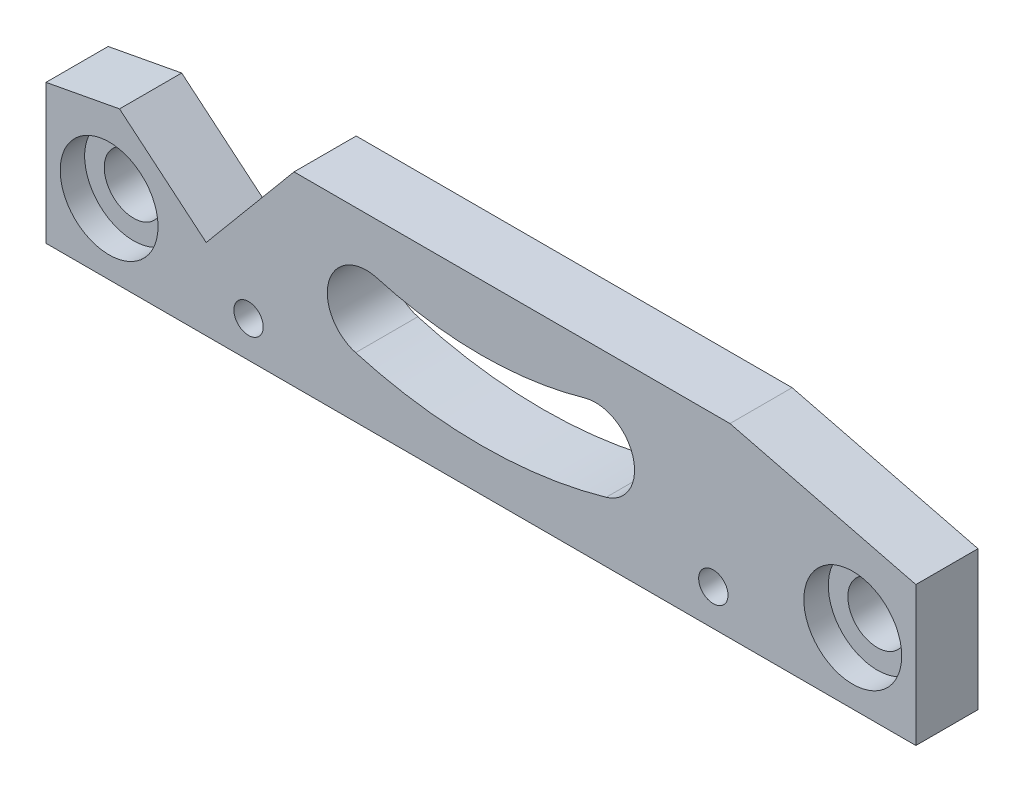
from build123d import *

# Parameters (mm, degrees)
BOSS_EXTRUDE1_DEPTH             = 3.175
CBORE_FOR_M6_SBHCS2_D           = 6
CBORE_FOR_M6_SBHCS2_CBORE_D     = 10
CBORE_FOR_M6_SBHCS2_CBORE_DEPTH = 2.5
F_3_0_3_DIAMETER_HOLE1_D        = 3
CUT_EXTRUDE1_REACH              = 50.756


with BuildPart() as part:
    # Sketch1 → Boss-Extrude1 (new, symmetric)
    with BuildSketch(Plane.XY):
        Polygon((-44.45, 0), (44.45, 0), (44.45, 14.25), (25.45, 19), (-19.1, 19), (-28.077889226, 8.257676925), (-36.933177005, 15.658477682), (-44.45, 14.25), align=None)
    extrude(amount=BOSS_EXTRUDE1_DEPTH, both=True)

    # CBORE for M6 SBHCS2 (through all)
    with Locations(Plane.XY.offset(3.175)):
        with Locations((-38, 7.2)):
            cbore_for_m6_sbhcs2 = CounterBoreHole(CBORE_FOR_M6_SBHCS2_D / 2, CBORE_FOR_M6_SBHCS2_CBORE_D / 2, CBORE_FOR_M6_SBHCS2_CBORE_DEPTH)

    # Mirror1: CBORE for M6 SBHCS2 across plane
    add(cbore_for_m6_sbhcs2.mirror(Plane(origin=(0, 0, 0), x_dir=(0, 0, 1), z_dir=(1, 0, 0))), mode=Mode.SUBTRACT)

    # 3.0 _3_ Diameter Hole1 (through all)
    with Locations(Plane.XY.offset(3.175)):
        with Locations((-23.75, 3.7)):
            f_3_0_3_diameter_hole1 = Hole(F_3_0_3_DIAMETER_HOLE1_D / 2)

    # Mirror2: 3.0 _3_ Diameter Hole1 across plane
    add(f_3_0_3_diameter_hole1.mirror(Plane(origin=(0, 0, 0), x_dir=(0, 0, 1), z_dir=(1, 0, 0))), mode=Mode.SUBTRACT)

    # Sketch10 → Cut-Extrude1 (cut, up to next)
    with BuildSketch(Plane.XY.offset(3.175), mode=Mode.PRIVATE) as cut_extrude1_sk1:
        with BuildLine():
            ThreePointArc((-12.803355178, 6.149394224), (0, 4.35), (12.803355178, 6.149394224))
            ThreePointArc((12.803355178, 6.149394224), (15.545852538, 11.096990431), (10.598256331, 13.839487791))
            ThreePointArc((10.598256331, 13.839487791), (0, 12.35), (-10.598256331, 13.839487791))
            ThreePointArc((-10.598256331, 13.839487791), (-15.545852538, 11.096990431), (-12.803355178, 6.149394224))
        make_face()
    cut_extrude1_tool1 = extrude(cut_extrude1_sk1.sketch, amount=-CUT_EXTRUDE1_REACH, mode=Mode.PRIVATE) & part.part
    add(cut_extrude1_tool1.solids().sort_by_distance((0, 9.128947, 3.175))[0], mode=Mode.SUBTRACT)


solid = part.part
